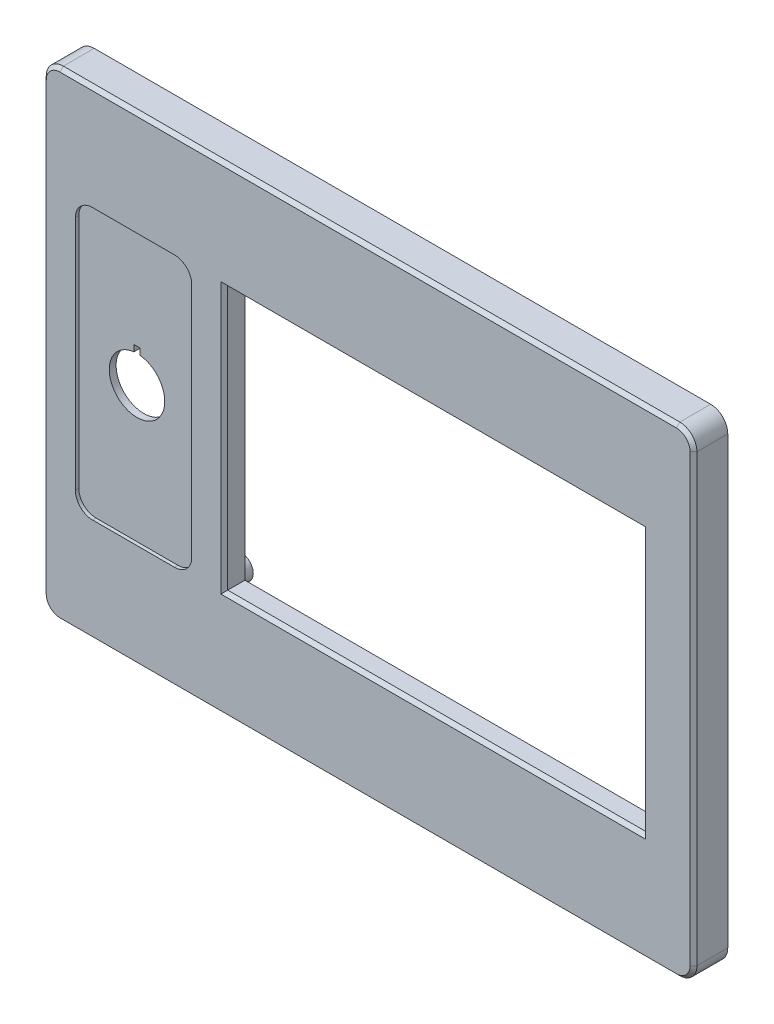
from build123d import *

# Parameters (mm, degrees)
BOSS_EXTRUDE1_DEPTH = 10
BOSS_EXTRUDE2_START = -3
BOSS_EXTRUDE2_DEPTH = 3
SKETCH3_W           = 122
SKETCH3_H           = 77
CUT_EXTRUDE1_DEPTH  = 3
SKETCH4_R           = 3.5
SKETCH4_R_2         = 2
LCD_STANDOFFS_DEPTH = 6
CHAMFER1_SIZE       = 1
BOSS_EXTRUDE4_START = 7
BOSS_EXTRUDE4_DEPTH = 7
SKETCH6_R           = 2.85
CUT_EXTRUDE2_DEPTH  = 6.5
LCD_CHAMFER_SIZE    = 1
SKETCH9_W           = 126
SKETCH9_H           = 81
SKETCH9_W_2         = 122
SKETCH9_H_2         = 77
BOSS_EXTRUDE6_DEPTH = 3
CUT_EXTRUDE4_DEPTH  = 1.6
CUT_EXTRUDE5_DEPTH  = 1
SKETCH12_W          = 48
SKETCH12_H          = 3
SKETCH12_W_2        = 3
SKETCH12_H_2        = 26.5
SKETCH12_W_3        = 10
BOSS_EXTRUDE7_DEPTH = 3
FILLET1_R           = 3


with BuildPart() as part:
    # Sketch1 → Boss-Extrude1 (new body)
    with BuildSketch(Plane.XY):
        with BuildLine():
            Line((-90, -70), (90, -70))
            ThreePointArc((90, -70), (93.535533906, -68.535533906), (95, -65))
            Line((95, -65), (95, 65))
            ThreePointArc((95, 65), (93.535533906, 68.535533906), (90, 70))
            Line((90, 70), (-90, 70))
            ThreePointArc((-90, 70), (-93.535533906, 68.535533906), (-95, 65))
            Line((-95, 65), (-95, -65))
            ThreePointArc((-95, -65), (-93.535533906, -68.535533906), (-90, -70))
        make_face()
        with BuildLine():
            Line((92, -65), (92, 65))
            ThreePointArc((92, 65), (91.414213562, 66.414213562), (90, 67))
            Line((90, 67), (-90, 67))
            ThreePointArc((-90, 67), (-91.414213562, 66.414213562), (-92, 65))
            Line((-92, 65), (-92, -65))
            ThreePointArc((-92, -65), (-91.414213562, -66.414213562), (-90, -67))
            Line((-90, -67), (90, -67))
            ThreePointArc((90, -67), (91.414213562, -66.414213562), (92, -65))
        make_face(mode=Mode.SUBTRACT)
    extrude(amount=BOSS_EXTRUDE1_DEPTH)

    # Sketch2 → Boss-Extrude2 (add)
    with BuildSketch(Plane.XY.offset(10).offset(BOSS_EXTRUDE2_START)):
        with BuildLine():
            Line((95, -65), (95, 65))
            ThreePointArc((95, 65), (93.535533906, 68.535533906), (90, 70))
            Line((90, 70), (-90, 70))
            ThreePointArc((-90, 70), (-93.535533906, 68.535533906), (-95, 65))
            Line((-95, 65), (-95, -65))
            ThreePointArc((-95, -65), (-93.535533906, -68.535533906), (-90, -70))
            Line((-90, -70), (90, -70))
            ThreePointArc((90, -70), (93.535533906, -68.535533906), (95, -65))
        make_face()
    extrude(amount=BOSS_EXTRUDE2_DEPTH)

    # Sketch3 → Cut-Extrude1 (cut)
    with BuildSketch(Plane.XY.offset(10)):
        with Locations((19, 0)):
            Rectangle(SKETCH3_W, SKETCH3_H)
        with BuildLine():
            Line((-69.4, 9.9), (-67.6, 9.9))
            Line((-67.6, 9.9), (-67.6, 8.049844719))
            ThreePointArc((-67.6, 8.049844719), (-68.5, -8.1), (-69.4, 8.049844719))
            Line((-69.4, 8.049844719), (-69.4, 9.9))
        make_face()
    extrude(amount=-CUT_EXTRUDE1_DEPTH, mode=Mode.SUBTRACT)

    # Sketch4 → LCD Standoffs (add)
    # profile 1 of 4: a face of its own
    with BuildSketch(Plane(origin=(0, 0, 7), x_dir=(-1, 0, 0), z_dir=(0, 0, -1))):
        with Locations(Location((-84.05, 38.55, 0), (0, 0, 180))):
            Circle(SKETCH4_R)
        with Locations((-84.05, 38.55)):
            Circle(SKETCH4_R_2, mode=Mode.SUBTRACT)
    # profile 2 of 4: a face of its own
    with BuildSketch(Plane(origin=(0, 0, 7), x_dir=(-1, 0, 0), z_dir=(0, 0, -1))):
        with Locations(Location((46.05, 38.55, 0), (0, 0, 180))):
            Circle(SKETCH4_R)
        with Locations((46.05, 38.55)):
            Circle(SKETCH4_R_2, mode=Mode.SUBTRACT)
    # profile 3 of 4: a face of its own
    with BuildSketch(Plane(origin=(0, 0, 7), x_dir=(-1, 0, 0), z_dir=(0, 0, -1))):
        with Locations(Location((46.05, -38.55, 0), (0, 0, 180))):
            Circle(SKETCH4_R)
        with Locations((46.05, -38.55)):
            Circle(SKETCH4_R_2, mode=Mode.SUBTRACT)
    # profile 4 of 4: a face of its own
    with BuildSketch(Plane(origin=(0, 0, 7), x_dir=(-1, 0, 0), z_dir=(0, 0, -1))):
        with Locations(Location((-84.05, -38.55, 0), (0, 0, 180))):
            Circle(SKETCH4_R)
        with Locations((-84.05, -38.55)):
            Circle(SKETCH4_R_2, mode=Mode.SUBTRACT)
    extrude(amount=LCD_STANDOFFS_DEPTH)

    # Chamfer1
    chamfer1_edges = [part.edges().sort_by_distance(p)[0] for p in [
        (93.535533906, -68.535533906, 10),
        (95, 0, 10),
        (93.535533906, 68.535533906, 10),
        (0, 70, 10),
        (-93.535533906, 68.535533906, 10),
        (-95, 0, 10),
        (-93.535533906, -68.535533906, 10),
        (0, -70, 10),
    ]]
    chamfer(chamfer1_edges, length=CHAMFER1_SIZE)

    # Sketch5 → Boss-Extrude4 (add)
    with BuildSketch(Plane(origin=(0, 0, 7), x_dir=(-1, 0, 0), z_dir=(0, 0, -1)).offset(BOSS_EXTRUDE4_START)):
        with BuildLine():
            Line((75, 67), (92, 50))
            Line((92, 50), (92, 65))
            ThreePointArc((92, 65), (91.414213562, 66.414213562), (90, 67))
            Line((90, 67), (75, 67))
        make_face()
        with BuildLine():
            Line((92, -50), (75, -67))
            Line((75, -67), (90, -67))
            ThreePointArc((90, -67), (91.414213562, -66.414213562), (92, -65))
            Line((92, -65), (92, -50))
        make_face()
        with BuildLine():
            Line((-90, -67), (-75, -67))
            Line((-75, -67), (-92, -50))
            Line((-92, -50), (-92, -65))
            ThreePointArc((-92, -65), (-91.414213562, -66.414213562), (-90, -67))
        make_face()
        with BuildLine():
            Line((-92, 65), (-92, 50))
            Line((-92, 50), (-75, 67))
            Line((-75, 67), (-90, 67))
            ThreePointArc((-90, 67), (-91.414213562, 66.414213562), (-92, 65))
        make_face()
    extrude(amount=-BOSS_EXTRUDE4_DEPTH)

    # Sketch6 → Cut-Extrude2 (cut)
    with BuildSketch(Plane(origin=(0, 0, 0), x_dir=(-1, 0, 0), z_dir=(0, 0, -1))):
        with Locations((89.516720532, -64.516720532)):
            Circle(SKETCH6_R)
        with Locations((-89.516720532, -64.516720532)):
            Circle(SKETCH6_R)
        with Locations((-89.516720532, 64.516720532)):
            Circle(SKETCH6_R)
        with Locations((89.516720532, 64.516720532)):
            Circle(SKETCH6_R)
    extrude(amount=-CUT_EXTRUDE2_DEPTH, mode=Mode.SUBTRACT)

    # LCD chamfer
    lcd_chamfer_edges = [part.edges().sort_by_distance(p)[0] for p in [
        (80, 0, 10),
        (19, 38.5, 10),
        (-42, 0, 10),
        (19, -38.5, 10),
    ]]
    chamfer(lcd_chamfer_edges, length=LCD_CHAMFER_SIZE)

    # Sketch9 → Boss-Extrude6 (add)
    with BuildSketch(Plane(origin=(0, 0, 7), x_dir=(-1, 0, 0), z_dir=(0, 0, -1))):
        with Locations((-19, 0)):
            Rectangle(SKETCH9_W, SKETCH9_H)
        with Locations((-19, 0)):
            Rectangle(SKETCH9_W_2, SKETCH9_H_2, mode=Mode.SUBTRACT)
    extrude(amount=BOSS_EXTRUDE6_DEPTH)

    # Sketch10 → Cut-Extrude4 (cut)
    with BuildSketch(Plane(origin=(0, 0, 0), x_dir=(-1, 0, 0), z_dir=(0, 0, -1))):
        Polygon((93.65, 50.683452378), (93.65, -50.683452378), (93.65, -54.754163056), (79.754163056, -68.65), (75.683452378, -68.65), (-75.683452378, -68.65), (-79.754163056, -68.65), (-93.65, -54.754163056), (-93.65, -50.683452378), (-93.65, 50.683452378), (-93.65, 54.754163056), (-79.754163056, 68.65), (-75.683452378, 68.65), (75.683452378, 68.65), (79.754163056, 68.65), (93.65, 54.754163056), align=None)
        Polygon((75, 67), (92, 50), (92, -50), (75, -67), (-75, -67), (-92, -50), (-92, 50), (-75, 67), align=None, mode=Mode.SUBTRACT)
    extrude(amount=-CUT_EXTRUDE4_DEPTH, mode=Mode.SUBTRACT)

    # Sketch11 → Cut-Extrude5 (cut)
    with BuildSketch(Plane.XY.offset(10)):
        with BuildLine():
            Line((-80.484242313, 39.5), (-56.515757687, 39.5))
            ThreePointArc((-56.515757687, 39.5), (-52.980223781, 38.035533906), (-51.515757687, 34.5))
            Line((-51.515757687, 34.5), (-51.515757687, -34.5))
            ThreePointArc((-51.515757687, -34.5), (-52.980223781, -38.035533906), (-56.515757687, -39.5))
            Line((-56.515757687, -39.5), (-80.484242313, -39.5))
            ThreePointArc((-80.484242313, -39.5), (-84.019776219, -38.035533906), (-85.484242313, -34.5))
            Line((-85.484242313, -34.5), (-85.484242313, 34.5))
            ThreePointArc((-85.484242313, 34.5), (-84.019776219, 38.035533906), (-80.484242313, 39.5))
        make_face()
        with BuildLine():
            Line((-67.6, 9.9), (-69.4, 9.9))
            Line((-69.4, 9.9), (-69.4, 8.049844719))
            ThreePointArc((-69.4, 8.049844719), (-68.5, -8.1), (-67.6, 8.049844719))
            Line((-67.6, 8.049844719), (-67.6, 9.9))
        make_face(mode=Mode.SUBTRACT)
    extrude(amount=-CUT_EXTRUDE5_DEPTH, mode=Mode.SUBTRACT)

    # Sketch12 → Boss-Extrude7 (add)
    with BuildSketch(Plane(origin=(0, 0, 7), x_dir=(-1, 0, 0), z_dir=(0, 0, -1))):
        with Locations((68, -16.5)):
            Rectangle(SKETCH12_W, SKETCH12_H)
        with Locations((68, 16.5)):
            Rectangle(SKETCH12_W, SKETCH12_H)
        with Locations((19.5, 53.75)):
            Rectangle(SKETCH12_W_2, SKETCH12_H_2)
        with Locations((-53.5, 53.75)):
            Rectangle(SKETCH12_W_2, SKETCH12_H_2)
        with Locations((-53.5, -53.75)):
            Rectangle(SKETCH12_W_2, SKETCH12_H_2)
        with Locations((19.5, -53.75)):
            Rectangle(SKETCH12_W_2, SKETCH12_H_2)
        with Locations((-87, 16.5)):
            Rectangle(SKETCH12_W_3, SKETCH12_H)
        with Locations((-87, -16.5)):
            Rectangle(SKETCH12_W_3, SKETCH12_H)
    extrude(amount=BOSS_EXTRUDE7_DEPTH)

    # Fillet1
    fillet1_edges = [part.edges().sort_by_distance(p)[0] for p in [
        (81.143541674, -40.5, 5.5),
        (82, -35.713188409, 5.5),
        (-44, -35.713188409, 5.5),
        (-43.143541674, 40.5, 5.5),
        (81.143541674, 40.5, 5.5),
        (-44, 35.713188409, 5.5),
        (82, 35.713188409, 5.5),
        (-43.143541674, -40.5, 5.5),
        (-92, 18, 5.5),
        (-92, 15, 5.5),
        (-44, 15, 5.5),
        (-44, 18, 5.5),
        (-18, 40.5, 5.5),
        (-18, 67, 5.5),
        (-21, 67, 5.5),
        (-21, 40.5, 5.5),
        (55, 40.5, 5.5),
        (55, 67, 5.5),
        (52, 67, 5.5),
        (52, 40.5, 5.5),
        (52, -40.5, 5.5),
        (52, -67, 5.5),
        (55, -67, 5.5),
        (55, -40.5, 5.5),
        (92, -18, 5.5),
        (92, -15, 5.5),
        (82, -15, 5.5),
        (82, -18, 5.5),
        (92, 15, 5.5),
        (92, 18, 5.5),
        (82, 18, 5.5),
        (82, 15, 5.5),
        (-21, -40.5, 5.5),
        (-21, -67, 5.5),
        (-18, -67, 5.5),
        (-18, -40.5, 5.5),
        (-92, -15, 5.5),
        (-92, -18, 5.5),
        (-44, -18, 5.5),
        (-44, -15, 5.5),
    ]]
    fillet(fillet1_edges, radius=FILLET1_R)


solid = part.part
